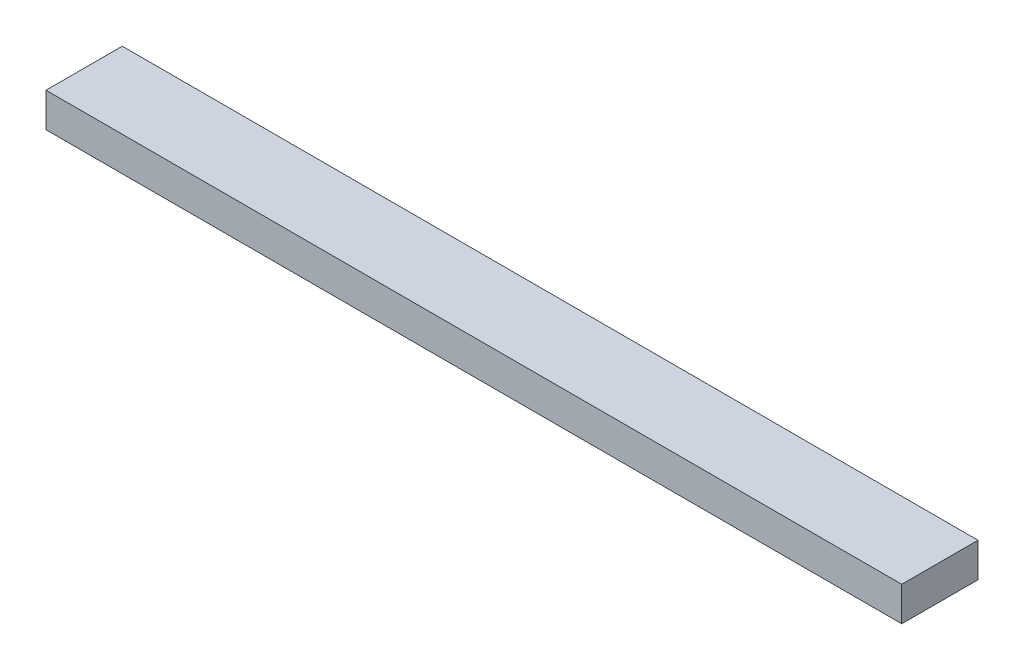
from build123d import *

# Parameters (mm, degrees)
SKETCH1_W           = 40.1
SKETCH1_H           = 18
BOSS_EXTRUDE1_DEPTH = 450


with BuildPart() as part:
    # Sketch1 → Boss-Extrude1 (new body)
    with BuildSketch(Plane(origin=(0, 0, 0), x_dir=(0, 0, -1), z_dir=(1, 0, 0))):
        with Locations((-5.149193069, -3.02030474)):
            Rectangle(SKETCH1_W, SKETCH1_H)
    extrude(amount=BOSS_EXTRUDE1_DEPTH)


solid = part.part
